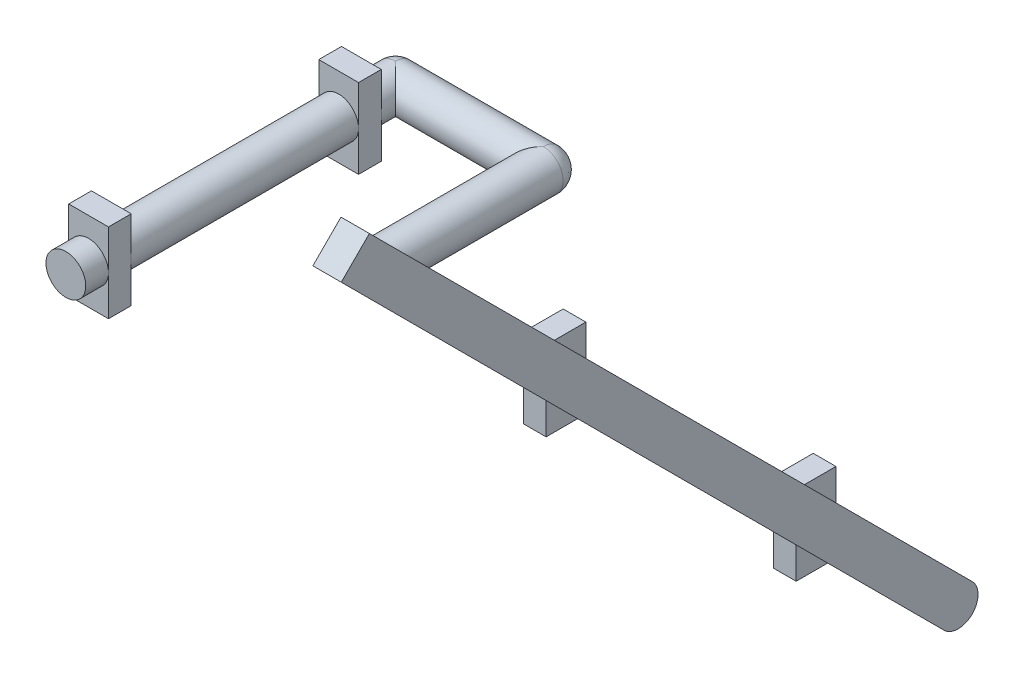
ISO-10303-21;
HEADER;
FILE_DESCRIPTION(('STEP AP214'),'2;1');
FILE_NAME('part.step','',(''),(''),'','','');
FILE_SCHEMA(('AUTOMOTIVE_DESIGN { 1 0 10303 214 1 1 1 1 }'));
ENDSEC;
DATA;
#1=APPLICATION_CONTEXT('core data for automotive mechanical design processes');
#2=APPLICATION_PROTOCOL_DEFINITION('international standard','automotive_design',2000,#1);
#3=PRODUCT_CONTEXT('',#1,'mechanical');
#4=PRODUCT('Part','Part','',(#3));
#5=PRODUCT_RELATED_PRODUCT_CATEGORY('part','',(#4));
#6=PRODUCT_DEFINITION_FORMATION('','',#4);
#7=PRODUCT_DEFINITION_CONTEXT('part definition',#1,'design');
#8=PRODUCT_DEFINITION('design','',#6,#7);
#9=PRODUCT_DEFINITION_SHAPE('','',#8);
#10=(LENGTH_UNIT() NAMED_UNIT(*) SI_UNIT(.MILLI.,.METRE.));
#11=(NAMED_UNIT(*) PLANE_ANGLE_UNIT() SI_UNIT($,.RADIAN.));
#12=(NAMED_UNIT(*) SI_UNIT($,.STERADIAN.) SOLID_ANGLE_UNIT());
#13=UNCERTAINTY_MEASURE_WITH_UNIT(LENGTH_MEASURE(1.E-05),#10,'distance_accuracy_value','');
#14=(GEOMETRIC_REPRESENTATION_CONTEXT(3) GLOBAL_UNCERTAINTY_ASSIGNED_CONTEXT((#13)) GLOBAL_UNIT_ASSIGNED_CONTEXT((#10,
#11,#12)) REPRESENTATION_CONTEXT('',''));
#15=CARTESIAN_POINT('',(0.,0.,0.));
#16=DIRECTION('',(0.,0.,1.));
#17=DIRECTION('',(1.,0.,0.));
#18=AXIS2_PLACEMENT_3D('',#15,#16,#17);
#19=CARTESIAN_POINT('',(104.,7.,-3.5));
#20=DIRECTION('',(1.,0.,0.));
#21=DIRECTION('',(0.,0.,-1.));
#22=AXIS2_PLACEMENT_3D('',#19,#20,#21);
#23=PLANE('',#22);
#24=CARTESIAN_POINT('',(104.,0.,0.));
#25=DIRECTION('',(1.,0.,0.));
#26=DIRECTION('',(0.,0.,-1.));
#27=AXIS2_PLACEMENT_3D('',#24,#25,#26);
#28=CIRCLE('',#27,3.5);
#29=CARTESIAN_POINT('',(104.,0.,-3.5));
#30=VERTEX_POINT('',#29);
#31=CARTESIAN_POINT('',(104.,0.,3.5));
#32=VERTEX_POINT('',#31);
#33=EDGE_CURVE('E43',#30,#32,#28,.T.);
#34=ORIENTED_EDGE('',*,*,#33,.F.);
#35=DIRECTION('',(0.,1.,0.));
#36=VECTOR('',#35,1.);
#37=CARTESIAN_POINT('',(104.,-7.,-3.5));
#38=LINE('',#37,#36);
#39=CARTESIAN_POINT('',(104.,7.,-3.5));
#40=VERTEX_POINT('',#39);
#41=EDGE_CURVE('E410',#30,#40,#38,.T.);
#42=ORIENTED_EDGE('',*,*,#41,.T.);
#43=DIRECTION('',(0.,0.,1.));
#44=VECTOR('',#43,1.);
#45=CARTESIAN_POINT('',(104.,7.,-3.5));
#46=LINE('',#45,#44);
#47=CARTESIAN_POINT('',(104.,7.,3.5));
#48=VERTEX_POINT('',#47);
#49=EDGE_CURVE('E413',#40,#48,#46,.T.);
#50=ORIENTED_EDGE('',*,*,#49,.T.);
#51=DIRECTION('',(0.,-1.,0.));
#52=VECTOR('',#51,1.);
#53=CARTESIAN_POINT('',(104.,7.,3.5));
#54=LINE('',#53,#52);
#55=EDGE_CURVE('E416',#48,#32,#54,.T.);
#56=ORIENTED_EDGE('',*,*,#55,.T.);
#57=EDGE_LOOP('',(#34,#42,#50,#56));
#58=FACE_BOUND('',#57,.T.);
#59=ADVANCED_FACE('F32',(#58),#23,.T.);
#60=CARTESIAN_POINT('',(60.,-7.,3.5));
#61=DIRECTION('',(1.,0.,0.));
#62=DIRECTION('',(0.,0.,-1.));
#63=AXIS2_PLACEMENT_3D('',#60,#61,#62);
#64=PLANE('',#63);
#65=CARTESIAN_POINT('',(60.,0.,0.));
#66=DIRECTION('',(1.,0.,0.));
#67=DIRECTION('',(0.,0.,-1.));
#68=AXIS2_PLACEMENT_3D('',#65,#66,#67);
#69=CIRCLE('',#68,3.5);
#70=CARTESIAN_POINT('',(60.,0.,-3.5));
#71=VERTEX_POINT('',#70);
#72=CARTESIAN_POINT('',(60.,0.,3.5));
#73=VERTEX_POINT('',#72);
#74=EDGE_CURVE('E433',#71,#73,#69,.T.);
#75=ORIENTED_EDGE('',*,*,#74,.F.);
#76=DIRECTION('',(0.,1.,0.));
#77=VECTOR('',#76,1.);
#78=CARTESIAN_POINT('',(60.,7.,-3.5));
#79=LINE('',#78,#77);
#80=CARTESIAN_POINT('',(60.,7.,-3.5));
#81=VERTEX_POINT('',#80);
#82=EDGE_CURVE('E457',#71,#81,#79,.T.);
#83=ORIENTED_EDGE('',*,*,#82,.T.);
#84=DIRECTION('',(0.,0.,1.));
#85=VECTOR('',#84,1.);
#86=CARTESIAN_POINT('',(60.,7.,3.5));
#87=LINE('',#86,#85);
#88=CARTESIAN_POINT('',(60.,7.,3.5));
#89=VERTEX_POINT('',#88);
#90=EDGE_CURVE('E460',#81,#89,#87,.T.);
#91=ORIENTED_EDGE('',*,*,#90,.T.);
#92=DIRECTION('',(0.,-1.,0.));
#93=VECTOR('',#92,1.);
#94=CARTESIAN_POINT('',(60.,7.,3.5));
#95=LINE('',#94,#93);
#96=EDGE_CURVE('E452',#89,#73,#95,.T.);
#97=ORIENTED_EDGE('',*,*,#96,.T.);
#98=EDGE_LOOP('',(#75,#83,#91,#97));
#99=FACE_BOUND('',#98,.T.);
#100=ADVANCED_FACE('F507',(#99),#64,.T.);
#101=CARTESIAN_POINT('',(26.,0.,-30.));
#102=DIRECTION('',(-1.,0.,0.));
#103=DIRECTION('',(0.,0.,1.));
#104=AXIS2_PLACEMENT_3D('',#101,#102,#103);
#105=CYLINDRICAL_SURFACE('',#104,3.5);
#106=CARTESIAN_POINT('',(0.,0.,-30.));
#107=DIRECTION('',(1.,0.,0.));
#108=DIRECTION('',(0.,0.,-1.));
#109=AXIS2_PLACEMENT_3D('',#106,#107,#108);
#110=CIRCLE('',#109,3.5);
#111=CARTESIAN_POINT('',(0.,-3.5,-30.));
#112=VERTEX_POINT('',#111);
#113=CARTESIAN_POINT('',(0.,3.5,-30.));
#114=VERTEX_POINT('',#113);
#115=EDGE_CURVE('E262',#112,#114,#110,.T.);
#116=ORIENTED_EDGE('',*,*,#115,.T.);
#117=CARTESIAN_POINT('',(0.,0.,-30.));
#118=DIRECTION('',(-0.707106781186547,0.,0.707106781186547));
#119=DIRECTION('',(0.707106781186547,0.,0.707106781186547));
#120=AXIS2_PLACEMENT_3D('',#117,#118,#119);
#121=ELLIPSE('',#120,4.94974746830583,3.5);
#122=EDGE_CURVE('E268',#114,#112,#121,.F.);
#123=ORIENTED_EDGE('',*,*,#122,.T.);
#124=EDGE_LOOP('',(#116,#123));
#125=FACE_BOUND('',#124,.T.);
#126=CARTESIAN_POINT('',(26.,0.,-30.));
#127=DIRECTION('',(-0.707106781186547,0.,-0.707106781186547));
#128=DIRECTION('',(-0.707106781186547,0.,0.707106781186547));
#129=AXIS2_PLACEMENT_3D('',#126,#127,#128);
#130=ELLIPSE('',#129,4.94974746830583,3.5);
#131=CARTESIAN_POINT('',(26.,3.5,-30.));
#132=VERTEX_POINT('',#131);
#133=CARTESIAN_POINT('',(26.,-3.5,-30.));
#134=VERTEX_POINT('',#133);
#135=EDGE_CURVE('E243',#132,#134,#130,.F.);
#136=ORIENTED_EDGE('',*,*,#135,.F.);
#137=CARTESIAN_POINT('',(26.,0.,-30.));
#138=DIRECTION('',(1.,0.,0.));
#139=DIRECTION('',(0.,0.,-1.));
#140=AXIS2_PLACEMENT_3D('',#137,#138,#139);
#141=CIRCLE('',#140,3.5);
#142=EDGE_CURVE('E265',#134,#132,#141,.T.);
#143=ORIENTED_EDGE('',*,*,#142,.F.);
#144=EDGE_LOOP('',(#136,#143));
#145=FACE_BOUND('',#144,.T.);
#146=ADVANCED_FACE('F566',(#125,#145),#105,.T.);
#147=CARTESIAN_POINT('',(0.,0.,-30.));
#148=DIRECTION('',(0.,0.,1.));
#149=DIRECTION('',(1.,0.,0.));
#150=AXIS2_PLACEMENT_3D('',#147,#148,#149);
#151=CYLINDRICAL_SURFACE('',#150,3.5);
#152=CARTESIAN_POINT('',(0.,0.,-24.));
#153=DIRECTION('',(0.,0.,-1.));
#154=DIRECTION('',(-1.,0.,0.));
#155=AXIS2_PLACEMENT_3D('',#152,#153,#154);
#156=CIRCLE('',#155,3.5);
#157=CARTESIAN_POINT('',(-3.5,0.,-24.));
#158=VERTEX_POINT('',#157);
#159=CARTESIAN_POINT('',(3.5,0.,-24.));
#160=VERTEX_POINT('',#159);
#161=EDGE_CURVE('E271',#158,#160,#156,.T.);
#162=ORIENTED_EDGE('',*,*,#161,.T.);
#163=EDGE_CURVE('E275',#160,#158,#156,.T.);
#164=ORIENTED_EDGE('',*,*,#163,.T.);
#165=EDGE_LOOP('',(#162,#164));
#166=FACE_BOUND('',#165,.T.);
#167=ORIENTED_EDGE('',*,*,#122,.F.);
#168=CARTESIAN_POINT('',(0.,0.,-30.));
#169=DIRECTION('',(0.,0.,-1.));
#170=DIRECTION('',(-1.,0.,0.));
#171=AXIS2_PLACEMENT_3D('',#168,#169,#170);
#172=CIRCLE('',#171,3.5);
#173=EDGE_CURVE('E274',#112,#114,#172,.T.);
#174=ORIENTED_EDGE('',*,*,#173,.F.);
#175=EDGE_LOOP('',(#167,#174));
#176=FACE_BOUND('',#175,.T.);
#177=ADVANCED_FACE('F619',(#166,#176),#151,.T.);
#178=CARTESIAN_POINT('',(-3.5,-7.,-24.));
#179=DIRECTION('',(0.,0.,-1.));
#180=DIRECTION('',(1.,0.,0.));
#181=AXIS2_PLACEMENT_3D('',#178,#179,#180);
#182=PLANE('',#181);
#183=ORIENTED_EDGE('',*,*,#161,.F.);
#184=DIRECTION('',(0.,-1.,0.));
#185=VECTOR('',#184,1.);
#186=CARTESIAN_POINT('',(-3.5,7.,-24.));
#187=LINE('',#186,#185);
#188=CARTESIAN_POINT('',(-3.5,7.,-24.));
#189=VERTEX_POINT('',#188);
#190=EDGE_CURVE('E291',#189,#158,#187,.T.);
#191=ORIENTED_EDGE('',*,*,#190,.F.);
#192=DIRECTION('',(-1.,0.,0.));
#193=VECTOR('',#192,1.);
#194=CARTESIAN_POINT('',(-3.5,7.,-24.));
#195=LINE('',#194,#193);
#196=CARTESIAN_POINT('',(3.5,7.,-24.));
#197=VERTEX_POINT('',#196);
#198=EDGE_CURVE('E293',#197,#189,#195,.T.);
#199=ORIENTED_EDGE('',*,*,#198,.F.);
#200=DIRECTION('',(0.,1.,0.));
#201=VECTOR('',#200,1.);
#202=CARTESIAN_POINT('',(3.5,7.,-24.));
#203=LINE('',#202,#201);
#204=EDGE_CURVE('E296',#160,#197,#203,.T.);
#205=ORIENTED_EDGE('',*,*,#204,.F.);
#206=EDGE_LOOP('',(#183,#191,#199,#205));
#207=FACE_BOUND('',#206,.T.);
#208=ADVANCED_FACE('F623',(#207),#182,.T.);
#209=CARTESIAN_POINT('',(-3.5,-7.,24.));
#210=DIRECTION('',(0.,0.,1.));
#211=DIRECTION('',(1.,0.,0.));
#212=AXIS2_PLACEMENT_3D('',#209,#210,#211);
#213=PLANE('',#212);
#214=CARTESIAN_POINT('',(0.,0.,24.));
#215=DIRECTION('',(0.,0.,1.));
#216=DIRECTION('',(1.,0.,0.));
#217=AXIS2_PLACEMENT_3D('',#214,#215,#216);
#218=CIRCLE('',#217,3.5);
#219=CARTESIAN_POINT('',(3.5,0.,24.));
#220=VERTEX_POINT('',#219);
#221=CARTESIAN_POINT('',(-3.5,0.,24.));
#222=VERTEX_POINT('',#221);
#223=EDGE_CURVE('E317',#220,#222,#218,.T.);
#224=ORIENTED_EDGE('',*,*,#223,.F.);
#225=DIRECTION('',(0.,1.,0.));
#226=VECTOR('',#225,1.);
#227=CARTESIAN_POINT('',(3.5,7.,24.));
#228=LINE('',#227,#226);
#229=CARTESIAN_POINT('',(3.5,7.,24.));
#230=VERTEX_POINT('',#229);
#231=EDGE_CURVE('E342',#220,#230,#228,.T.);
#232=ORIENTED_EDGE('',*,*,#231,.T.);
#233=DIRECTION('',(-1.,0.,0.));
#234=VECTOR('',#233,1.);
#235=CARTESIAN_POINT('',(-3.5,7.,24.));
#236=LINE('',#235,#234);
#237=CARTESIAN_POINT('',(-3.5,7.,24.));
#238=VERTEX_POINT('',#237);
#239=EDGE_CURVE('E345',#230,#238,#236,.T.);
#240=ORIENTED_EDGE('',*,*,#239,.T.);
#241=DIRECTION('',(0.,-1.,0.));
#242=VECTOR('',#241,1.);
#243=CARTESIAN_POINT('',(-3.5,7.,24.));
#244=LINE('',#243,#242);
#245=EDGE_CURVE('E337',#238,#222,#244,.T.);
#246=ORIENTED_EDGE('',*,*,#245,.T.);
#247=EDGE_LOOP('',(#224,#232,#240,#246));
#248=FACE_BOUND('',#247,.T.);
#249=ADVANCED_FACE('F528',(#248),#213,.T.);
#250=CARTESIAN_POINT('',(0.,0.,20.));
#251=DIRECTION('',(0.,0.,-1.));
#252=DIRECTION('',(-1.,0.,0.));
#253=AXIS2_PLACEMENT_3D('',#250,#251,#252);
#254=CYLINDRICAL_SURFACE('',#253,3.5);
#255=CARTESIAN_POINT('',(0.,0.,20.));
#256=DIRECTION('',(0.,0.,1.));
#257=DIRECTION('',(1.,0.,0.));
#258=AXIS2_PLACEMENT_3D('',#255,#256,#257);
#259=CIRCLE('',#258,3.5);
#260=CARTESIAN_POINT('',(3.5,0.,20.));
#261=VERTEX_POINT('',#260);
#262=CARTESIAN_POINT('',(-3.5,0.,20.));
#263=VERTEX_POINT('',#262);
#264=EDGE_CURVE('E360',#261,#263,#259,.T.);
#265=ORIENTED_EDGE('',*,*,#264,.F.);
#266=EDGE_CURVE('E359',#263,#261,#259,.T.);
#267=ORIENTED_EDGE('',*,*,#266,.F.);
#268=EDGE_LOOP('',(#265,#267));
#269=FACE_BOUND('',#268,.T.);
#270=CARTESIAN_POINT('',(0.,0.,-20.));
#271=DIRECTION('',(0.,0.,1.));
#272=DIRECTION('',(1.,0.,0.));
#273=AXIS2_PLACEMENT_3D('',#270,#271,#272);
#274=CIRCLE('',#273,3.5);
#275=CARTESIAN_POINT('',(3.5,0.,-20.));
#276=VERTEX_POINT('',#275);
#277=CARTESIAN_POINT('',(-3.5,0.,-20.));
#278=VERTEX_POINT('',#277);
#279=EDGE_CURVE('E314',#276,#278,#274,.T.);
#280=ORIENTED_EDGE('',*,*,#279,.T.);
#281=EDGE_CURVE('E313',#278,#276,#274,.T.);
#282=ORIENTED_EDGE('',*,*,#281,.T.);
#283=EDGE_LOOP('',(#280,#282));
#284=FACE_BOUND('',#283,.T.);
#285=ADVANCED_FACE('F34',(#269,#284),#254,.T.);
#286=CARTESIAN_POINT('',(-3.5,-7.,20.));
#287=DIRECTION('',(0.,0.,1.));
#288=DIRECTION('',(1.,0.,0.));
#289=AXIS2_PLACEMENT_3D('',#286,#287,#288);
#290=PLANE('',#289);
#291=DIRECTION('',(0.,1.,0.));
#292=VECTOR('',#291,1.);
#293=CARTESIAN_POINT('',(3.5,7.,20.));
#294=LINE('',#293,#292);
#295=CARTESIAN_POINT('',(3.5,7.,20.));
#296=VERTEX_POINT('',#295);
#297=EDGE_CURVE('E330',#261,#296,#294,.T.);
#298=ORIENTED_EDGE('',*,*,#297,.F.);
#299=ORIENTED_EDGE('',*,*,#264,.T.);
#300=DIRECTION('',(0.,-1.,0.));
#301=VECTOR('',#300,1.);
#302=CARTESIAN_POINT('',(-3.5,7.,20.));
#303=LINE('',#302,#301);
#304=CARTESIAN_POINT('',(-3.5,7.,20.));
#305=VERTEX_POINT('',#304);
#306=EDGE_CURVE('E325',#305,#263,#303,.T.);
#307=ORIENTED_EDGE('',*,*,#306,.F.);
#308=DIRECTION('',(-1.,0.,0.));
#309=VECTOR('',#308,1.);
#310=CARTESIAN_POINT('',(-3.5,7.,20.));
#311=LINE('',#310,#309);
#312=EDGE_CURVE('E334',#296,#305,#311,.T.);
#313=ORIENTED_EDGE('',*,*,#312,.F.);
#314=EDGE_LOOP('',(#298,#299,#307,#313));
#315=FACE_BOUND('',#314,.T.);
#316=ADVANCED_FACE('F538',(#315),#290,.F.);
#317=CARTESIAN_POINT('',(-3.5,-7.,20.));
#318=VERTEX_POINT('',#317);
#319=EDGE_CURVE('E324',#263,#318,#303,.T.);
#320=ORIENTED_EDGE('',*,*,#319,.F.);
#321=ORIENTED_EDGE('',*,*,#266,.T.);
#322=CARTESIAN_POINT('',(3.5,-7.,20.));
#323=VERTEX_POINT('',#322);
#324=EDGE_CURVE('E331',#323,#261,#294,.T.);
#325=ORIENTED_EDGE('',*,*,#324,.F.);
#326=DIRECTION('',(1.,0.,0.));
#327=VECTOR('',#326,1.);
#328=CARTESIAN_POINT('',(-3.5,-7.,20.));
#329=LINE('',#328,#327);
#330=EDGE_CURVE('E328',#318,#323,#329,.T.);
#331=ORIENTED_EDGE('',*,*,#330,.F.);
#332=EDGE_LOOP('',(#320,#321,#325,#331));
#333=FACE_BOUND('',#332,.T.);
#334=ADVANCED_FACE('F544',(#333),#290,.F.);
#335=CARTESIAN_POINT('',(-3.5,7.,24.));
#336=DIRECTION('',(1.,0.,0.));
#337=DIRECTION('',(0.,1.,0.));
#338=AXIS2_PLACEMENT_3D('',#335,#336,#337);
#339=PLANE('',#338);
#340=ORIENTED_EDGE('',*,*,#306,.T.);
#341=ORIENTED_EDGE('',*,*,#319,.T.);
#342=DIRECTION('',(0.,0.,-1.));
#343=VECTOR('',#342,1.);
#344=CARTESIAN_POINT('',(-3.5,-7.,24.));
#345=LINE('',#344,#343);
#346=CARTESIAN_POINT('',(-3.5,-7.,24.));
#347=VERTEX_POINT('',#346);
#348=EDGE_CURVE('E356',#347,#318,#345,.T.);
#349=ORIENTED_EDGE('',*,*,#348,.F.);
#350=EDGE_CURVE('E336',#222,#347,#244,.T.);
#351=ORIENTED_EDGE('',*,*,#350,.F.);
#352=ORIENTED_EDGE('',*,*,#245,.F.);
#353=DIRECTION('',(0.,0.,-1.));
#354=VECTOR('',#353,1.);
#355=CARTESIAN_POINT('',(-3.5,7.,24.));
#356=LINE('',#355,#354);
#357=EDGE_CURVE('E347',#238,#305,#356,.T.);
#358=ORIENTED_EDGE('',*,*,#357,.T.);
#359=EDGE_LOOP('',(#340,#341,#349,#351,#352,#358));
#360=FACE_BOUND('',#359,.T.);
#361=ADVANCED_FACE('F526',(#360),#339,.F.);
#362=CARTESIAN_POINT('',(-3.5,-7.,24.));
#363=DIRECTION('',(0.,1.,0.));
#364=DIRECTION('',(0.,0.,1.));
#365=AXIS2_PLACEMENT_3D('',#362,#363,#364);
#366=PLANE('',#365);
#367=ORIENTED_EDGE('',*,*,#330,.T.);
#368=DIRECTION('',(0.,0.,-1.));
#369=VECTOR('',#368,1.);
#370=CARTESIAN_POINT('',(3.5,-7.,24.));
#371=LINE('',#370,#369);
#372=CARTESIAN_POINT('',(3.5,-7.,24.));
#373=VERTEX_POINT('',#372);
#374=EDGE_CURVE('E353',#373,#323,#371,.T.);
#375=ORIENTED_EDGE('',*,*,#374,.F.);
#376=DIRECTION('',(1.,0.,0.));
#377=VECTOR('',#376,1.);
#378=CARTESIAN_POINT('',(-3.5,-7.,24.));
#379=LINE('',#378,#377);
#380=EDGE_CURVE('E340',#347,#373,#379,.T.);
#381=ORIENTED_EDGE('',*,*,#380,.F.);
#382=ORIENTED_EDGE('',*,*,#348,.T.);
#383=EDGE_LOOP('',(#367,#375,#381,#382));
#384=FACE_BOUND('',#383,.T.);
#385=ADVANCED_FACE('F548',(#384),#366,.F.);
#386=CARTESIAN_POINT('',(3.5,7.,24.));
#387=DIRECTION('',(-1.,0.,0.));
#388=DIRECTION('',(0.,-1.,0.));
#389=AXIS2_PLACEMENT_3D('',#386,#387,#388);
#390=PLANE('',#389);
#391=ORIENTED_EDGE('',*,*,#324,.T.);
#392=ORIENTED_EDGE('',*,*,#297,.T.);
#393=DIRECTION('',(0.,0.,-1.));
#394=VECTOR('',#393,1.);
#395=CARTESIAN_POINT('',(3.5,7.,24.));
#396=LINE('',#395,#394);
#397=EDGE_CURVE('E350',#230,#296,#396,.T.);
#398=ORIENTED_EDGE('',*,*,#397,.F.);
#399=ORIENTED_EDGE('',*,*,#231,.F.);
#400=EDGE_CURVE('E343',#373,#220,#228,.T.);
#401=ORIENTED_EDGE('',*,*,#400,.F.);
#402=ORIENTED_EDGE('',*,*,#374,.T.);
#403=EDGE_LOOP('',(#391,#392,#398,#399,#401,#402));
#404=FACE_BOUND('',#403,.T.);
#405=ADVANCED_FACE('F550',(#404),#390,.F.);
#406=CARTESIAN_POINT('',(-3.5,7.,24.));
#407=DIRECTION('',(0.,-1.,0.));
#408=DIRECTION('',(0.,0.,-1.));
#409=AXIS2_PLACEMENT_3D('',#406,#407,#408);
#410=PLANE('',#409);
#411=ORIENTED_EDGE('',*,*,#312,.T.);
#412=ORIENTED_EDGE('',*,*,#357,.F.);
#413=ORIENTED_EDGE('',*,*,#239,.F.);
#414=ORIENTED_EDGE('',*,*,#397,.T.);
#415=EDGE_LOOP('',(#411,#412,#413,#414));
#416=FACE_BOUND('',#415,.T.);
#417=ADVANCED_FACE('F533',(#416),#410,.F.);
#418=EDGE_CURVE('E321',#222,#220,#218,.T.);
#419=ORIENTED_EDGE('',*,*,#418,.F.);
#420=ORIENTED_EDGE('',*,*,#350,.T.);
#421=ORIENTED_EDGE('',*,*,#380,.T.);
#422=ORIENTED_EDGE('',*,*,#400,.T.);
#423=EDGE_LOOP('',(#419,#420,#421,#422));
#424=FACE_BOUND('',#423,.T.);
#425=ADVANCED_FACE('F519',(#424),#213,.T.);
#426=CARTESIAN_POINT('',(0.,0.,28.));
#427=DIRECTION('',(0.,0.,-1.));
#428=DIRECTION('',(-1.,0.,0.));
#429=AXIS2_PLACEMENT_3D('',#426,#427,#428);
#430=CYLINDRICAL_SURFACE('',#429,3.5);
#431=CARTESIAN_POINT('',(0.,0.,28.));
#432=DIRECTION('',(0.,0.,1.));
#433=DIRECTION('',(1.,0.,0.));
#434=AXIS2_PLACEMENT_3D('',#431,#432,#433);
#435=CIRCLE('',#434,3.5);
#436=CARTESIAN_POINT('',(3.5,0.,28.));
#437=VERTEX_POINT('',#436);
#438=EDGE_CURVE('E320',#437,#437,#435,.T.);
#439=ORIENTED_EDGE('',*,*,#438,.F.);
#440=EDGE_LOOP('',(#439));
#441=FACE_BOUND('',#440,.T.);
#442=ORIENTED_EDGE('',*,*,#223,.T.);
#443=ORIENTED_EDGE('',*,*,#418,.T.);
#444=EDGE_LOOP('',(#442,#443));
#445=FACE_BOUND('',#444,.T.);
#446=ADVANCED_FACE('F515',(#441,#445),#430,.T.);
#447=CARTESIAN_POINT('',(0.,0.,28.));
#448=DIRECTION('',(0.,0.,1.));
#449=DIRECTION('',(1.,0.,0.));
#450=AXIS2_PLACEMENT_3D('',#447,#448,#449);
#451=PLANE('',#450);
#452=ORIENTED_EDGE('',*,*,#438,.T.);
#453=EDGE_LOOP('',(#452));
#454=FACE_BOUND('',#453,.T.);
#455=ADVANCED_FACE('F648',(#454),#451,.T.);
#456=CARTESIAN_POINT('',(-3.5,-7.,-20.));
#457=DIRECTION('',(0.,0.,-1.));
#458=DIRECTION('',(1.,0.,0.));
#459=AXIS2_PLACEMENT_3D('',#456,#457,#458);
#460=PLANE('',#459);
#461=ORIENTED_EDGE('',*,*,#279,.F.);
#462=DIRECTION('',(0.,1.,0.));
#463=VECTOR('',#462,1.);
#464=CARTESIAN_POINT('',(3.5,7.,-20.));
#465=LINE('',#464,#463);
#466=CARTESIAN_POINT('',(3.5,7.,-20.));
#467=VERTEX_POINT('',#466);
#468=EDGE_CURVE('E284',#276,#467,#465,.T.);
#469=ORIENTED_EDGE('',*,*,#468,.T.);
#470=DIRECTION('',(-1.,0.,0.));
#471=VECTOR('',#470,1.);
#472=CARTESIAN_POINT('',(-3.5,7.,-20.));
#473=LINE('',#472,#471);
#474=CARTESIAN_POINT('',(-3.5,7.,-20.));
#475=VERTEX_POINT('',#474);
#476=EDGE_CURVE('E281',#467,#475,#473,.T.);
#477=ORIENTED_EDGE('',*,*,#476,.T.);
#478=DIRECTION('',(0.,-1.,0.));
#479=VECTOR('',#478,1.);
#480=CARTESIAN_POINT('',(-3.5,7.,-20.));
#481=LINE('',#480,#479);
#482=EDGE_CURVE('E278',#475,#278,#481,.T.);
#483=ORIENTED_EDGE('',*,*,#482,.T.);
#484=EDGE_LOOP('',(#461,#469,#477,#483));
#485=FACE_BOUND('',#484,.T.);
#486=ADVANCED_FACE('F628',(#485),#460,.F.);
#487=CARTESIAN_POINT('',(-3.5,7.,-24.));
#488=DIRECTION('',(-1.,0.,0.));
#489=DIRECTION('',(0.,-1.,0.));
#490=AXIS2_PLACEMENT_3D('',#487,#488,#489);
#491=PLANE('',#490);
#492=ORIENTED_EDGE('',*,*,#482,.F.);
#493=DIRECTION('',(0.,0.,1.));
#494=VECTOR('',#493,1.);
#495=CARTESIAN_POINT('',(-3.5,7.,-24.));
#496=LINE('',#495,#494);
#497=EDGE_CURVE('E311',#189,#475,#496,.T.);
#498=ORIENTED_EDGE('',*,*,#497,.F.);
#499=ORIENTED_EDGE('',*,*,#190,.T.);
#500=CARTESIAN_POINT('',(-3.5,-7.,-24.));
#501=VERTEX_POINT('',#500);
#502=EDGE_CURVE('E290',#158,#501,#187,.T.);
#503=ORIENTED_EDGE('',*,*,#502,.T.);
#504=DIRECTION('',(0.,0.,1.));
#505=VECTOR('',#504,1.);
#506=CARTESIAN_POINT('',(-3.5,-7.,-24.));
#507=LINE('',#506,#505);
#508=CARTESIAN_POINT('',(-3.5,-7.,-20.));
#509=VERTEX_POINT('',#508);
#510=EDGE_CURVE('E303',#501,#509,#507,.T.);
#511=ORIENTED_EDGE('',*,*,#510,.T.);
#512=EDGE_CURVE('E277',#278,#509,#481,.T.);
#513=ORIENTED_EDGE('',*,*,#512,.F.);
#514=EDGE_LOOP('',(#492,#498,#499,#503,#511,#513));
#515=FACE_BOUND('',#514,.T.);
#516=ADVANCED_FACE('F643',(#515),#491,.T.);
#517=CARTESIAN_POINT('',(-3.5,7.,-24.));
#518=DIRECTION('',(0.,1.,0.));
#519=DIRECTION('',(0.,0.,1.));
#520=AXIS2_PLACEMENT_3D('',#517,#518,#519);
#521=PLANE('',#520);
#522=ORIENTED_EDGE('',*,*,#476,.F.);
#523=DIRECTION('',(0.,0.,1.));
#524=VECTOR('',#523,1.);
#525=CARTESIAN_POINT('',(3.5,7.,-24.));
#526=LINE('',#525,#524);
#527=EDGE_CURVE('E308',#197,#467,#526,.T.);
#528=ORIENTED_EDGE('',*,*,#527,.F.);
#529=ORIENTED_EDGE('',*,*,#198,.T.);
#530=ORIENTED_EDGE('',*,*,#497,.T.);
#531=EDGE_LOOP('',(#522,#528,#529,#530));
#532=FACE_BOUND('',#531,.T.);
#533=ADVANCED_FACE('F639',(#532),#521,.T.);
#534=CARTESIAN_POINT('',(3.5,7.,-24.));
#535=DIRECTION('',(1.,0.,0.));
#536=DIRECTION('',(0.,1.,0.));
#537=AXIS2_PLACEMENT_3D('',#534,#535,#536);
#538=PLANE('',#537);
#539=CARTESIAN_POINT('',(3.5,-7.,-20.));
#540=VERTEX_POINT('',#539);
#541=EDGE_CURVE('E285',#540,#276,#465,.T.);
#542=ORIENTED_EDGE('',*,*,#541,.F.);
#543=DIRECTION('',(0.,0.,1.));
#544=VECTOR('',#543,1.);
#545=CARTESIAN_POINT('',(3.5,-7.,-24.));
#546=LINE('',#545,#544);
#547=CARTESIAN_POINT('',(3.5,-7.,-24.));
#548=VERTEX_POINT('',#547);
#549=EDGE_CURVE('E306',#548,#540,#546,.T.);
#550=ORIENTED_EDGE('',*,*,#549,.F.);
#551=EDGE_CURVE('E297',#548,#160,#203,.T.);
#552=ORIENTED_EDGE('',*,*,#551,.T.);
#553=ORIENTED_EDGE('',*,*,#204,.T.);
#554=ORIENTED_EDGE('',*,*,#527,.T.);
#555=ORIENTED_EDGE('',*,*,#468,.F.);
#556=EDGE_LOOP('',(#542,#550,#552,#553,#554,#555));
#557=FACE_BOUND('',#556,.T.);
#558=ADVANCED_FACE('F635',(#557),#538,.T.);
#559=CARTESIAN_POINT('',(-3.5,-7.,-24.));
#560=DIRECTION('',(0.,-1.,0.));
#561=DIRECTION('',(0.,0.,-1.));
#562=AXIS2_PLACEMENT_3D('',#559,#560,#561);
#563=PLANE('',#562);
#564=DIRECTION('',(1.,0.,0.));
#565=VECTOR('',#564,1.);
#566=CARTESIAN_POINT('',(-3.5,-7.,-20.));
#567=LINE('',#566,#565);
#568=EDGE_CURVE('E287',#509,#540,#567,.T.);
#569=ORIENTED_EDGE('',*,*,#568,.F.);
#570=ORIENTED_EDGE('',*,*,#510,.F.);
#571=DIRECTION('',(1.,0.,0.));
#572=VECTOR('',#571,1.);
#573=CARTESIAN_POINT('',(-3.5,-7.,-24.));
#574=LINE('',#573,#572);
#575=EDGE_CURVE('E300',#501,#548,#574,.T.);
#576=ORIENTED_EDGE('',*,*,#575,.T.);
#577=ORIENTED_EDGE('',*,*,#549,.T.);
#578=EDGE_LOOP('',(#569,#570,#576,#577));
#579=FACE_BOUND('',#578,.T.);
#580=ADVANCED_FACE('F631',(#579),#563,.T.);
#581=ORIENTED_EDGE('',*,*,#163,.F.);
#582=ORIENTED_EDGE('',*,*,#551,.F.);
#583=ORIENTED_EDGE('',*,*,#575,.F.);
#584=ORIENTED_EDGE('',*,*,#502,.F.);
#585=EDGE_LOOP('',(#581,#582,#583,#584));
#586=FACE_BOUND('',#585,.T.);
#587=ADVANCED_FACE('F626',(#586),#182,.T.);
#588=ORIENTED_EDGE('',*,*,#281,.F.);
#589=ORIENTED_EDGE('',*,*,#512,.T.);
#590=ORIENTED_EDGE('',*,*,#568,.T.);
#591=ORIENTED_EDGE('',*,*,#541,.T.);
#592=EDGE_LOOP('',(#588,#589,#590,#591));
#593=FACE_BOUND('',#592,.T.);
#594=ADVANCED_FACE('F616',(#593),#460,.F.);
#595=CARTESIAN_POINT('',(26.,0.,-30.));
#596=DIRECTION('',(0.,0.,-1.));
#597=DIRECTION('',(-1.,0.,0.));
#598=AXIS2_PLACEMENT_3D('',#595,#596,#597);
#599=CYLINDRICAL_SURFACE('',#598,3.5);
#600=CARTESIAN_POINT('',(26.,0.,0.));
#601=DIRECTION('',(0.,0.,-1.));
#602=DIRECTION('',(-1.,0.,0.));
#603=AXIS2_PLACEMENT_3D('',#600,#601,#602);
#604=CIRCLE('',#603,3.5);
#605=CARTESIAN_POINT('',(26.,-3.5,0.));
#606=VERTEX_POINT('',#605);
#607=CARTESIAN_POINT('',(26.,3.5,0.));
#608=VERTEX_POINT('',#607);
#609=EDGE_CURVE('E236',#606,#608,#604,.T.);
#610=ORIENTED_EDGE('',*,*,#609,.T.);
#611=CARTESIAN_POINT('',(26.,0.,0.));
#612=DIRECTION('',(-0.707106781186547,0.,-0.707106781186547));
#613=DIRECTION('',(0.707106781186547,0.,-0.707106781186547));
#614=AXIS2_PLACEMENT_3D('',#611,#612,#613);
#615=ELLIPSE('',#614,4.94974746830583,3.5);
#616=EDGE_CURVE('E240',#608,#606,#615,.T.);
#617=ORIENTED_EDGE('',*,*,#616,.T.);
#618=EDGE_LOOP('',(#610,#617));
#619=FACE_BOUND('',#618,.T.);
#620=CARTESIAN_POINT('',(26.,0.,-30.));
#621=DIRECTION('',(0.,0.,-1.));
#622=DIRECTION('',(-1.,0.,0.));
#623=AXIS2_PLACEMENT_3D('',#620,#621,#622);
#624=CIRCLE('',#623,3.5);
#625=EDGE_CURVE('E244',#132,#134,#624,.T.);
#626=ORIENTED_EDGE('',*,*,#625,.F.);
#627=ORIENTED_EDGE('',*,*,#135,.T.);
#628=EDGE_LOOP('',(#626,#627));
#629=FACE_BOUND('',#628,.T.);
#630=ADVANCED_FACE('F238',(#619,#629),#599,.T.);
#631=CARTESIAN_POINT('',(26.,0.,0.));
#632=DIRECTION('',(-1.,0.,0.));
#633=DIRECTION('',(0.,0.,1.));
#634=AXIS2_PLACEMENT_3D('',#631,#632,#633);
#635=CYLINDRICAL_SURFACE('',#634,3.5);
#636=CARTESIAN_POINT('',(56.,0.,0.));
#637=DIRECTION('',(-1.,0.,0.));
#638=DIRECTION('',(0.,0.,1.));
#639=AXIS2_PLACEMENT_3D('',#636,#637,#638);
#640=CIRCLE('',#639,3.5);
#641=CARTESIAN_POINT('',(56.,0.,3.5));
#642=VERTEX_POINT('',#641);
#643=CARTESIAN_POINT('',(56.,0.,-3.5));
#644=VERTEX_POINT('',#643);
#645=EDGE_CURVE('E251',#642,#644,#640,.T.);
#646=ORIENTED_EDGE('',*,*,#645,.T.);
#647=EDGE_CURVE('E254',#644,#642,#640,.T.);
#648=ORIENTED_EDGE('',*,*,#647,.T.);
#649=EDGE_LOOP('',(#646,#648));
#650=FACE_BOUND('',#649,.T.);
#651=ORIENTED_EDGE('',*,*,#616,.F.);
#652=CARTESIAN_POINT('',(26.,0.,0.));
#653=DIRECTION('',(-1.,0.,0.));
#654=DIRECTION('',(0.,0.,1.));
#655=AXIS2_PLACEMENT_3D('',#652,#653,#654);
#656=CIRCLE('',#655,3.5);
#657=EDGE_CURVE('E248',#606,#608,#656,.T.);
#658=ORIENTED_EDGE('',*,*,#657,.F.);
#659=EDGE_LOOP('',(#651,#658));
#660=FACE_BOUND('',#659,.T.);
#661=ADVANCED_FACE('F247',(#650,#660),#635,.T.);
#662=CARTESIAN_POINT('',(56.,-7.,3.5));
#663=DIRECTION('',(1.,0.,0.));
#664=DIRECTION('',(0.,0.,-1.));
#665=AXIS2_PLACEMENT_3D('',#662,#663,#664);
#666=PLANE('',#665);
#667=ORIENTED_EDGE('',*,*,#645,.F.);
#668=DIRECTION('',(0.,-1.,0.));
#669=VECTOR('',#668,1.);
#670=CARTESIAN_POINT('',(56.,7.,3.5));
#671=LINE('',#670,#669);
#672=CARTESIAN_POINT('',(56.,7.,3.5));
#673=VERTEX_POINT('',#672);
#674=EDGE_CURVE('E441',#673,#642,#671,.T.);
#675=ORIENTED_EDGE('',*,*,#674,.F.);
#676=DIRECTION('',(0.,0.,1.));
#677=VECTOR('',#676,1.);
#678=CARTESIAN_POINT('',(56.,7.,3.5));
#679=LINE('',#678,#677);
#680=CARTESIAN_POINT('',(56.,7.,-3.5));
#681=VERTEX_POINT('',#680);
#682=EDGE_CURVE('E449',#681,#673,#679,.T.);
#683=ORIENTED_EDGE('',*,*,#682,.F.);
#684=DIRECTION('',(0.,1.,0.));
#685=VECTOR('',#684,1.);
#686=CARTESIAN_POINT('',(56.,7.,-3.5));
#687=LINE('',#686,#685);
#688=EDGE_CURVE('E445',#644,#681,#687,.T.);
#689=ORIENTED_EDGE('',*,*,#688,.F.);
#690=EDGE_LOOP('',(#667,#675,#683,#689));
#691=FACE_BOUND('',#690,.T.);
#692=ADVANCED_FACE('F486',(#691),#666,.F.);
#693=CARTESIAN_POINT('',(60.,7.,3.5));
#694=DIRECTION('',(0.,0.,-1.));
#695=DIRECTION('',(0.,1.,0.));
#696=AXIS2_PLACEMENT_3D('',#693,#694,#695);
#697=PLANE('',#696);
#698=ORIENTED_EDGE('',*,*,#674,.T.);
#699=CARTESIAN_POINT('',(56.,-7.,3.5));
#700=VERTEX_POINT('',#699);
#701=EDGE_CURVE('E440',#642,#700,#671,.T.);
#702=ORIENTED_EDGE('',*,*,#701,.T.);
#703=DIRECTION('',(-1.,0.,0.));
#704=VECTOR('',#703,1.);
#705=CARTESIAN_POINT('',(60.,-7.,3.5));
#706=LINE('',#705,#704);
#707=CARTESIAN_POINT('',(60.,-7.,3.5));
#708=VERTEX_POINT('',#707);
#709=EDGE_CURVE('E470',#708,#700,#706,.T.);
#710=ORIENTED_EDGE('',*,*,#709,.F.);
#711=EDGE_CURVE('E451',#73,#708,#95,.T.);
#712=ORIENTED_EDGE('',*,*,#711,.F.);
#713=ORIENTED_EDGE('',*,*,#96,.F.);
#714=DIRECTION('',(-1.,0.,0.));
#715=VECTOR('',#714,1.);
#716=CARTESIAN_POINT('',(60.,7.,3.5));
#717=LINE('',#716,#715);
#718=EDGE_CURVE('E462',#89,#673,#717,.T.);
#719=ORIENTED_EDGE('',*,*,#718,.T.);
#720=EDGE_LOOP('',(#698,#702,#710,#712,#713,#719));
#721=FACE_BOUND('',#720,.T.);
#722=ADVANCED_FACE('F498',(#721),#697,.F.);
#723=CARTESIAN_POINT('',(60.,-7.,3.5));
#724=DIRECTION('',(0.,1.,0.));
#725=DIRECTION('',(0.,0.,1.));
#726=AXIS2_PLACEMENT_3D('',#723,#724,#725);
#727=PLANE('',#726);
#728=DIRECTION('',(0.,0.,-1.));
#729=VECTOR('',#728,1.);
#730=CARTESIAN_POINT('',(56.,-7.,3.5));
#731=LINE('',#730,#729);
#732=CARTESIAN_POINT('',(56.,-7.,-3.5));
#733=VERTEX_POINT('',#732);
#734=EDGE_CURVE('E443',#700,#733,#731,.T.);
#735=ORIENTED_EDGE('',*,*,#734,.T.);
#736=DIRECTION('',(-1.,0.,0.));
#737=VECTOR('',#736,1.);
#738=CARTESIAN_POINT('',(60.,-7.,-3.5));
#739=LINE('',#738,#737);
#740=CARTESIAN_POINT('',(60.,-7.,-3.5));
#741=VERTEX_POINT('',#740);
#742=EDGE_CURVE('E468',#741,#733,#739,.T.);
#743=ORIENTED_EDGE('',*,*,#742,.F.);
#744=DIRECTION('',(0.,0.,-1.));
#745=VECTOR('',#744,1.);
#746=CARTESIAN_POINT('',(60.,-7.,3.5));
#747=LINE('',#746,#745);
#748=EDGE_CURVE('E455',#708,#741,#747,.T.);
#749=ORIENTED_EDGE('',*,*,#748,.F.);
#750=ORIENTED_EDGE('',*,*,#709,.T.);
#751=EDGE_LOOP('',(#735,#743,#749,#750));
#752=FACE_BOUND('',#751,.T.);
#753=ADVANCED_FACE('F494',(#752),#727,.F.);
#754=CARTESIAN_POINT('',(60.,7.,-3.5));
#755=DIRECTION('',(0.,0.,1.));
#756=DIRECTION('',(0.,-1.,0.));
#757=AXIS2_PLACEMENT_3D('',#754,#755,#756);
#758=PLANE('',#757);
#759=EDGE_CURVE('E446',#733,#644,#687,.T.);
#760=ORIENTED_EDGE('',*,*,#759,.T.);
#761=ORIENTED_EDGE('',*,*,#688,.T.);
#762=DIRECTION('',(-1.,0.,0.));
#763=VECTOR('',#762,1.);
#764=CARTESIAN_POINT('',(60.,7.,-3.5));
#765=LINE('',#764,#763);
#766=EDGE_CURVE('E465',#81,#681,#765,.T.);
#767=ORIENTED_EDGE('',*,*,#766,.F.);
#768=ORIENTED_EDGE('',*,*,#82,.F.);
#769=EDGE_CURVE('E458',#741,#71,#79,.T.);
#770=ORIENTED_EDGE('',*,*,#769,.F.);
#771=ORIENTED_EDGE('',*,*,#742,.T.);
#772=EDGE_LOOP('',(#760,#761,#767,#768,#770,#771));
#773=FACE_BOUND('',#772,.T.);
#774=ADVANCED_FACE('F490',(#773),#758,.F.);
#775=CARTESIAN_POINT('',(60.,7.,3.5));
#776=DIRECTION('',(0.,-1.,0.));
#777=DIRECTION('',(0.,0.,-1.));
#778=AXIS2_PLACEMENT_3D('',#775,#776,#777);
#779=PLANE('',#778);
#780=ORIENTED_EDGE('',*,*,#682,.T.);
#781=ORIENTED_EDGE('',*,*,#718,.F.);
#782=ORIENTED_EDGE('',*,*,#90,.F.);
#783=ORIENTED_EDGE('',*,*,#766,.T.);
#784=EDGE_LOOP('',(#780,#781,#782,#783));
#785=FACE_BOUND('',#784,.T.);
#786=ADVANCED_FACE('F503',(#785),#779,.F.);
#787=EDGE_CURVE('E41',#73,#71,#69,.T.);
#788=ORIENTED_EDGE('',*,*,#787,.F.);
#789=ORIENTED_EDGE('',*,*,#711,.T.);
#790=ORIENTED_EDGE('',*,*,#748,.T.);
#791=ORIENTED_EDGE('',*,*,#769,.T.);
#792=EDGE_LOOP('',(#788,#789,#790,#791));
#793=FACE_BOUND('',#792,.T.);
#794=ADVANCED_FACE('F568',(#793),#64,.T.);
#795=ORIENTED_EDGE('',*,*,#647,.F.);
#796=ORIENTED_EDGE('',*,*,#759,.F.);
#797=ORIENTED_EDGE('',*,*,#734,.F.);
#798=ORIENTED_EDGE('',*,*,#701,.F.);
#799=EDGE_LOOP('',(#795,#796,#797,#798));
#800=FACE_BOUND('',#799,.T.);
#801=ADVANCED_FACE('F482',(#800),#666,.F.);
#802=CARTESIAN_POINT('',(100.,0.,0.));
#803=DIRECTION('',(-1.,0.,0.));
#804=DIRECTION('',(0.,0.,1.));
#805=AXIS2_PLACEMENT_3D('',#802,#803,#804);
#806=CYLINDRICAL_SURFACE('',#805,3.5);
#807=ORIENTED_EDGE('',*,*,#74,.T.);
#808=ORIENTED_EDGE('',*,*,#787,.T.);
#809=EDGE_LOOP('',(#807,#808));
#810=FACE_BOUND('',#809,.T.);
#811=CARTESIAN_POINT('',(100.,0.,0.));
#812=DIRECTION('',(1.,0.,0.));
#813=DIRECTION('',(0.,0.,-1.));
#814=AXIS2_PLACEMENT_3D('',#811,#812,#813);
#815=CIRCLE('',#814,3.5);
#816=CARTESIAN_POINT('',(100.,0.,-3.5));
#817=VERTEX_POINT('',#816);
#818=CARTESIAN_POINT('',(100.,0.,3.5));
#819=VERTEX_POINT('',#818);
#820=EDGE_CURVE('E437',#817,#819,#815,.T.);
#821=ORIENTED_EDGE('',*,*,#820,.F.);
#822=EDGE_CURVE('E436',#819,#817,#815,.T.);
#823=ORIENTED_EDGE('',*,*,#822,.F.);
#824=EDGE_LOOP('',(#821,#823));
#825=FACE_BOUND('',#824,.T.);
#826=ADVANCED_FACE('F509',(#810,#825),#806,.T.);
#827=CARTESIAN_POINT('',(100.,7.,-3.5));
#828=DIRECTION('',(1.,0.,0.));
#829=DIRECTION('',(0.,0.,-1.));
#830=AXIS2_PLACEMENT_3D('',#827,#828,#829);
#831=PLANE('',#830);
#832=DIRECTION('',(0.,1.,0.));
#833=VECTOR('',#832,1.);
#834=CARTESIAN_POINT('',(100.,0.,-3.5));
#835=LINE('',#834,#833);
#836=CARTESIAN_POINT('',(100.,7.,-3.5));
#837=VERTEX_POINT('',#836);
#838=EDGE_CURVE('E364',#817,#837,#835,.T.);
#839=ORIENTED_EDGE('',*,*,#838,.F.);
#840=ORIENTED_EDGE('',*,*,#820,.T.);
#841=DIRECTION('',(0.,-1.,0.));
#842=VECTOR('',#841,1.);
#843=CARTESIAN_POINT('',(100.,0.,3.5));
#844=LINE('',#843,#842);
#845=CARTESIAN_POINT('',(100.,7.,3.5));
#846=VERTEX_POINT('',#845);
#847=EDGE_CURVE('E404',#846,#819,#844,.T.);
#848=ORIENTED_EDGE('',*,*,#847,.F.);
#849=DIRECTION('',(0.,0.,1.));
#850=VECTOR('',#849,1.);
#851=CARTESIAN_POINT('',(100.,7.,-3.5));
#852=LINE('',#851,#850);
#853=EDGE_CURVE('E400',#837,#846,#852,.T.);
#854=ORIENTED_EDGE('',*,*,#853,.F.);
#855=EDGE_LOOP('',(#839,#840,#848,#854));
#856=FACE_BOUND('',#855,.T.);
#857=ADVANCED_FACE('F600',(#856),#831,.F.);
#858=CARTESIAN_POINT('',(100.,-7.,3.5));
#859=VERTEX_POINT('',#858);
#860=EDGE_CURVE('E403',#819,#859,#844,.T.);
#861=ORIENTED_EDGE('',*,*,#860,.F.);
#862=ORIENTED_EDGE('',*,*,#822,.T.);
#863=CARTESIAN_POINT('',(100.,-7.,-3.5));
#864=VERTEX_POINT('',#863);
#865=EDGE_CURVE('E397',#864,#817,#835,.T.);
#866=ORIENTED_EDGE('',*,*,#865,.F.);
#867=DIRECTION('',(0.,0.,-1.));
#868=VECTOR('',#867,1.);
#869=CARTESIAN_POINT('',(100.,-7.,3.5));
#870=LINE('',#869,#868);
#871=EDGE_CURVE('E407',#859,#864,#870,.T.);
#872=ORIENTED_EDGE('',*,*,#871,.F.);
#873=EDGE_LOOP('',(#861,#862,#866,#872));
#874=FACE_BOUND('',#873,.T.);
#875=ADVANCED_FACE('F596',(#874),#831,.F.);
#876=CARTESIAN_POINT('',(104.,0.,-3.5));
#877=DIRECTION('',(0.,0.,1.));
#878=DIRECTION('',(0.,-1.,0.));
#879=AXIS2_PLACEMENT_3D('',#876,#877,#878);
#880=PLANE('',#879);
#881=ORIENTED_EDGE('',*,*,#865,.T.);
#882=ORIENTED_EDGE('',*,*,#838,.T.);
#883=DIRECTION('',(-1.,0.,0.));
#884=VECTOR('',#883,1.);
#885=CARTESIAN_POINT('',(104.,7.,-3.5));
#886=LINE('',#885,#884);
#887=EDGE_CURVE('E430',#40,#837,#886,.T.);
#888=ORIENTED_EDGE('',*,*,#887,.F.);
#889=ORIENTED_EDGE('',*,*,#41,.F.);
#890=CARTESIAN_POINT('',(104.,-7.,-3.5));
#891=VERTEX_POINT('',#890);
#892=EDGE_CURVE('E411',#891,#30,#38,.T.);
#893=ORIENTED_EDGE('',*,*,#892,.F.);
#894=DIRECTION('',(-1.,0.,0.));
#895=VECTOR('',#894,1.);
#896=CARTESIAN_POINT('',(104.,-7.,-3.5));
#897=LINE('',#896,#895);
#898=EDGE_CURVE('E421',#891,#864,#897,.T.);
#899=ORIENTED_EDGE('',*,*,#898,.T.);
#900=EDGE_LOOP('',(#881,#882,#888,#889,#893,#899));
#901=FACE_BOUND('',#900,.T.);
#902=ADVANCED_FACE('F592',(#901),#880,.F.);
#903=CARTESIAN_POINT('',(104.,7.,-3.5));
#904=DIRECTION('',(0.,-1.,0.));
#905=DIRECTION('',(0.,0.,-1.));
#906=AXIS2_PLACEMENT_3D('',#903,#904,#905);
#907=PLANE('',#906);
#908=ORIENTED_EDGE('',*,*,#853,.T.);
#909=DIRECTION('',(-1.,0.,0.));
#910=VECTOR('',#909,1.);
#911=CARTESIAN_POINT('',(104.,7.,3.5));
#912=LINE('',#911,#910);
#913=EDGE_CURVE('E427',#48,#846,#912,.T.);
#914=ORIENTED_EDGE('',*,*,#913,.F.);
#915=ORIENTED_EDGE('',*,*,#49,.F.);
#916=ORIENTED_EDGE('',*,*,#887,.T.);
#917=EDGE_LOOP('',(#908,#914,#915,#916));
#918=FACE_BOUND('',#917,.T.);
#919=ADVANCED_FACE('F586',(#918),#907,.F.);
#920=CARTESIAN_POINT('',(104.,0.,3.5));
#921=DIRECTION('',(0.,0.,-1.));
#922=DIRECTION('',(0.,1.,0.));
#923=AXIS2_PLACEMENT_3D('',#920,#921,#922);
#924=PLANE('',#923);
#925=ORIENTED_EDGE('',*,*,#847,.T.);
#926=ORIENTED_EDGE('',*,*,#860,.T.);
#927=DIRECTION('',(-1.,0.,0.));
#928=VECTOR('',#927,1.);
#929=CARTESIAN_POINT('',(104.,-7.,3.5));
#930=LINE('',#929,#928);
#931=CARTESIAN_POINT('',(104.,-7.,3.5));
#932=VERTEX_POINT('',#931);
#933=EDGE_CURVE('E424',#932,#859,#930,.T.);
#934=ORIENTED_EDGE('',*,*,#933,.F.);
#935=EDGE_CURVE('E415',#32,#932,#54,.T.);
#936=ORIENTED_EDGE('',*,*,#935,.F.);
#937=ORIENTED_EDGE('',*,*,#55,.F.);
#938=ORIENTED_EDGE('',*,*,#913,.T.);
#939=EDGE_LOOP('',(#925,#926,#934,#936,#937,#938));
#940=FACE_BOUND('',#939,.T.);
#941=ADVANCED_FACE('F581',(#940),#924,.F.);
#942=CARTESIAN_POINT('',(104.,-7.,3.5));
#943=DIRECTION('',(0.,1.,0.));
#944=DIRECTION('',(0.,0.,1.));
#945=AXIS2_PLACEMENT_3D('',#942,#943,#944);
#946=PLANE('',#945);
#947=ORIENTED_EDGE('',*,*,#871,.T.);
#948=ORIENTED_EDGE('',*,*,#898,.F.);
#949=DIRECTION('',(0.,0.,-1.));
#950=VECTOR('',#949,1.);
#951=CARTESIAN_POINT('',(104.,-7.,3.5));
#952=LINE('',#951,#950);
#953=EDGE_CURVE('E419',#932,#891,#952,.T.);
#954=ORIENTED_EDGE('',*,*,#953,.F.);
#955=ORIENTED_EDGE('',*,*,#933,.T.);
#956=EDGE_LOOP('',(#947,#948,#954,#955));
#957=FACE_BOUND('',#956,.T.);
#958=ADVANCED_FACE('F574',(#957),#946,.F.);
#959=EDGE_CURVE('E11',#32,#30,#28,.T.);
#960=ORIENTED_EDGE('',*,*,#959,.F.);
#961=ORIENTED_EDGE('',*,*,#935,.T.);
#962=ORIENTED_EDGE('',*,*,#953,.T.);
#963=ORIENTED_EDGE('',*,*,#892,.T.);
#964=EDGE_LOOP('',(#960,#961,#962,#963));
#965=FACE_BOUND('',#964,.T.);
#966=ADVANCED_FACE('F562',(#965),#23,.T.);
#967=CARTESIAN_POINT('',(124.,0.,0.));
#968=DIRECTION('',(-1.,0.,0.));
#969=DIRECTION('',(0.,0.,1.));
#970=AXIS2_PLACEMENT_3D('',#967,#968,#969);
#971=CYLINDRICAL_SURFACE('',#970,3.5);
#972=CARTESIAN_POINT('',(124.,0.,0.));
#973=DIRECTION('',(1.,0.,0.));
#974=DIRECTION('',(0.,0.,-1.));
#975=AXIS2_PLACEMENT_3D('',#972,#973,#974);
#976=CIRCLE('',#975,3.5);
#977=CARTESIAN_POINT('',(124.,2.47487373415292,-2.47487373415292));
#978=VERTEX_POINT('',#977);
#979=CARTESIAN_POINT('',(124.,-2.47487373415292,2.47487373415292));
#980=VERTEX_POINT('',#979);
#981=EDGE_CURVE('E50',#978,#980,#976,.T.);
#982=ORIENTED_EDGE('',*,*,#981,.F.);
#983=DIRECTION('',(-1.,0.,0.));
#984=VECTOR('',#983,1.);
#985=CARTESIAN_POINT('',(129.,2.47487373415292,-2.47487373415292));
#986=LINE('',#985,#984);
#987=CARTESIAN_POINT('',(129.,2.47487373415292,-2.47487373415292));
#988=VERTEX_POINT('',#987);
#989=EDGE_CURVE('E367',#988,#978,#986,.T.);
#990=ORIENTED_EDGE('',*,*,#989,.F.);
#991=CARTESIAN_POINT('',(129.,0.,0.));
#992=DIRECTION('',(1.,0.,0.));
#993=DIRECTION('',(0.,0.,-1.));
#994=AXIS2_PLACEMENT_3D('',#991,#992,#993);
#995=CIRCLE('',#994,3.50000000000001);
#996=CARTESIAN_POINT('',(129.,-2.47487373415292,2.47487373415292));
#997=VERTEX_POINT('',#996);
#998=EDGE_CURVE('E1046',#997,#988,#995,.T.);
#999=ORIENTED_EDGE('',*,*,#998,.F.);
#1000=DIRECTION('',(-1.,0.,0.));
#1001=VECTOR('',#1000,1.);
#1002=CARTESIAN_POINT('',(129.,-2.47487373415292,2.47487373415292));
#1003=LINE('',#1002,#1001);
#1004=EDGE_CURVE('E370',#997,#980,#1003,.T.);
#1005=ORIENTED_EDGE('',*,*,#1004,.T.);
#1006=EDGE_LOOP('',(#982,#990,#999,#1005));
#1007=FACE_BOUND('',#1006,.T.);
#1008=ORIENTED_EDGE('',*,*,#33,.T.);
#1009=ORIENTED_EDGE('',*,*,#959,.T.);
#1010=EDGE_LOOP('',(#1008,#1009));
#1011=FACE_BOUND('',#1010,.T.);
#1012=ADVANCED_FACE('F573',(#1007,#1011),#971,.T.);
#1013=CARTESIAN_POINT('',(124.,0.,0.));
#1014=DIRECTION('',(1.,0.,0.));
#1015=DIRECTION('',(0.,0.,-1.));
#1016=AXIS2_PLACEMENT_3D('',#1013,#1014,#1015);
#1017=PLANE('',#1016);
#1018=DIRECTION('',(0.,0.707106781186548,0.707106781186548));
#1019=VECTOR('',#1018,1.);
#1020=CARTESIAN_POINT('',(124.,108.540890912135,103.591143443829));
#1021=LINE('',#1020,#1019);
#1022=CARTESIAN_POINT('',(124.,108.540890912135,103.591143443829));
#1023=VERTEX_POINT('',#1022);
#1024=EDGE_CURVE('E374',#978,#1023,#1021,.T.);
#1025=ORIENTED_EDGE('',*,*,#1024,.F.);
#1026=ORIENTED_EDGE('',*,*,#981,.T.);
#1027=DIRECTION('',(0.,-0.707106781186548,-0.707106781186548));
#1028=VECTOR('',#1027,1.);
#1029=CARTESIAN_POINT('',(124.,103.591143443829,108.540890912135));
#1030=LINE('',#1029,#1028);
#1031=CARTESIAN_POINT('',(124.,103.591143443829,108.540890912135));
#1032=VERTEX_POINT('',#1031);
#1033=EDGE_CURVE('E377',#1032,#980,#1030,.T.);
#1034=ORIENTED_EDGE('',*,*,#1033,.F.);
#1035=DIRECTION('',(0.,-0.707106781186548,0.707106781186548));
#1036=VECTOR('',#1035,1.);
#1037=CARTESIAN_POINT('',(124.,108.540890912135,103.591143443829));
#1038=LINE('',#1037,#1036);
#1039=EDGE_CURVE('E381',#1023,#1032,#1038,.T.);
#1040=ORIENTED_EDGE('',*,*,#1039,.F.);
#1041=EDGE_LOOP('',(#1025,#1026,#1034,#1040));
#1042=FACE_BOUND('',#1041,.T.);
#1043=ADVANCED_FACE('F579',(#1042),#1017,.F.);
#1044=CARTESIAN_POINT('',(129.,108.540890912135,103.591143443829));
#1045=DIRECTION('',(0.,-0.707106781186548,-0.707106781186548));
#1046=DIRECTION('',(0.,0.707106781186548,-0.707106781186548));
#1047=AXIS2_PLACEMENT_3D('',#1044,#1045,#1046);
#1048=PLANE('',#1047);
#1049=ORIENTED_EDGE('',*,*,#1039,.T.);
#1050=DIRECTION('',(-1.,0.,0.));
#1051=VECTOR('',#1050,1.);
#1052=CARTESIAN_POINT('',(129.,103.591143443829,108.540890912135));
#1053=LINE('',#1052,#1051);
#1054=CARTESIAN_POINT('',(129.,103.591143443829,108.540890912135));
#1055=VERTEX_POINT('',#1054);
#1056=EDGE_CURVE('E384',#1055,#1032,#1053,.T.);
#1057=ORIENTED_EDGE('',*,*,#1056,.F.);
#1058=DIRECTION('',(0.,-0.707106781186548,0.707106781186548));
#1059=VECTOR('',#1058,1.);
#1060=CARTESIAN_POINT('',(129.,108.540890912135,103.591143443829));
#1061=LINE('',#1060,#1059);
#1062=CARTESIAN_POINT('',(129.,108.540890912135,103.591143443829));
#1063=VERTEX_POINT('',#1062);
#1064=EDGE_CURVE('E376',#1063,#1055,#1061,.T.);
#1065=ORIENTED_EDGE('',*,*,#1064,.F.);
#1066=DIRECTION('',(-1.,0.,0.));
#1067=VECTOR('',#1066,1.);
#1068=CARTESIAN_POINT('',(129.,108.540890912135,103.591143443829));
#1069=LINE('',#1068,#1067);
#1070=EDGE_CURVE('E371',#1063,#1023,#1069,.T.);
#1071=ORIENTED_EDGE('',*,*,#1070,.T.);
#1072=EDGE_LOOP('',(#1049,#1057,#1065,#1071));
#1073=FACE_BOUND('',#1072,.T.);
#1074=ADVANCED_FACE('F694',(#1073),#1048,.F.);
#1075=CARTESIAN_POINT('',(129.,103.591143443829,108.540890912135));
#1076=DIRECTION('',(0.,0.707106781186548,-0.707106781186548));
#1077=DIRECTION('',(0.,0.707106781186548,0.707106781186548));
#1078=AXIS2_PLACEMENT_3D('',#1075,#1076,#1077);
#1079=PLANE('',#1078);
#1080=ORIENTED_EDGE('',*,*,#1033,.T.);
#1081=ORIENTED_EDGE('',*,*,#1004,.F.);
#1082=DIRECTION('',(0.,-0.707106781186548,-0.707106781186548));
#1083=VECTOR('',#1082,1.);
#1084=CARTESIAN_POINT('',(129.,103.591143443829,108.540890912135));
#1085=LINE('',#1084,#1083);
#1086=EDGE_CURVE('E1044',#1055,#997,#1085,.T.);
#1087=ORIENTED_EDGE('',*,*,#1086,.F.);
#1088=ORIENTED_EDGE('',*,*,#1056,.T.);
#1089=EDGE_LOOP('',(#1080,#1081,#1087,#1088));
#1090=FACE_BOUND('',#1089,.T.);
#1091=ADVANCED_FACE('F698',(#1090),#1079,.F.);
#1092=CARTESIAN_POINT('',(129.,108.540890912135,103.591143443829));
#1093=DIRECTION('',(0.,-0.707106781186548,0.707106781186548));
#1094=DIRECTION('',(0.,-0.707106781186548,-0.707106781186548));
#1095=AXIS2_PLACEMENT_3D('',#1092,#1093,#1094);
#1096=PLANE('',#1095);
#1097=ORIENTED_EDGE('',*,*,#1024,.T.);
#1098=ORIENTED_EDGE('',*,*,#1070,.F.);
#1099=DIRECTION('',(0.,0.707106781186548,0.707106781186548));
#1100=VECTOR('',#1099,1.);
#1101=CARTESIAN_POINT('',(129.,108.540890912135,103.591143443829));
#1102=LINE('',#1101,#1100);
#1103=EDGE_CURVE('E1047',#988,#1063,#1102,.T.);
#1104=ORIENTED_EDGE('',*,*,#1103,.F.);
#1105=ORIENTED_EDGE('',*,*,#989,.T.);
#1106=EDGE_LOOP('',(#1097,#1098,#1104,#1105));
#1107=FACE_BOUND('',#1106,.T.);
#1108=ADVANCED_FACE('F688',(#1107),#1096,.F.);
#1109=CARTESIAN_POINT('',(129.,0.,0.));
#1110=DIRECTION('',(1.,0.,0.));
#1111=DIRECTION('',(0.,0.,-1.));
#1112=AXIS2_PLACEMENT_3D('',#1109,#1110,#1111);
#1113=PLANE('',#1112);
#1114=ORIENTED_EDGE('',*,*,#1064,.T.);
#1115=ORIENTED_EDGE('',*,*,#1086,.T.);
#1116=ORIENTED_EDGE('',*,*,#998,.T.);
#1117=ORIENTED_EDGE('',*,*,#1103,.T.);
#1118=EDGE_LOOP('',(#1114,#1115,#1116,#1117));
#1119=FACE_BOUND('',#1118,.T.);
#1120=ADVANCED_FACE('F680',(#1119),#1113,.T.);
#1121=CARTESIAN_POINT('',(0.,0.,-30.));
#1122=DIRECTION('',(0.,-1.,0.));
#1123=DIRECTION('',(1.,0.,0.));
#1124=AXIS2_PLACEMENT_3D('',#1121,#1122,#1123);
#1125=SPHERICAL_SURFACE('',#1124,3.5);
#1126=ORIENTED_EDGE('',*,*,#115,.F.);
#1127=ORIENTED_EDGE('',*,*,#173,.T.);
#1128=EDGE_LOOP('',(#1126,#1127));
#1129=FACE_BOUND('',#1128,.T.);
#1130=ADVANCED_FACE('F677',(#1129),#1125,.T.);
#1131=CARTESIAN_POINT('',(26.,0.,-30.));
#1132=DIRECTION('',(0.,-1.,0.));
#1133=DIRECTION('',(1.,0.,0.));
#1134=AXIS2_PLACEMENT_3D('',#1131,#1132,#1133);
#1135=SPHERICAL_SURFACE('',#1134,3.5);
#1136=ORIENTED_EDGE('',*,*,#142,.T.);
#1137=ORIENTED_EDGE('',*,*,#625,.T.);
#1138=EDGE_LOOP('',(#1136,#1137));
#1139=FACE_BOUND('',#1138,.T.);
#1140=ADVANCED_FACE('F679',(#1139),#1135,.T.);
#1141=CARTESIAN_POINT('',(26.,0.,0.));
#1142=DIRECTION('',(0.,1.,0.));
#1143=DIRECTION('',(1.,0.,0.));
#1144=AXIS2_PLACEMENT_3D('',#1141,#1142,#1143);
#1145=SPHERICAL_SURFACE('',#1144,3.5);
#1146=ORIENTED_EDGE('',*,*,#609,.F.);
#1147=ORIENTED_EDGE('',*,*,#657,.T.);
#1148=EDGE_LOOP('',(#1146,#1147));
#1149=FACE_BOUND('',#1148,.T.);
#1150=ADVANCED_FACE('F250',(#1149),#1145,.T.);
#1151=CLOSED_SHELL('',(#59,#100,#146,#177,#208,#249,#285,#316,#334,#361,#385,#405,#417,#425,
#446,#455,#486,#516,#533,#558,#580,#587,#594,#630,#661,#692,#722,#753,#774,#786,#794,#801,#826,
#857,#875,#902,#919,#941,#958,#966,#1012,#1043,#1074,#1091,#1108,#1120,#1130,#1140,#1150));
#1152=MANIFOLD_SOLID_BREP('B2',#1151);
#1153=ADVANCED_BREP_SHAPE_REPRESENTATION('',(#18,#1152),#14);
#1154=SHAPE_DEFINITION_REPRESENTATION(#9,#1153);
ENDSEC;
END-ISO-10303-21;
